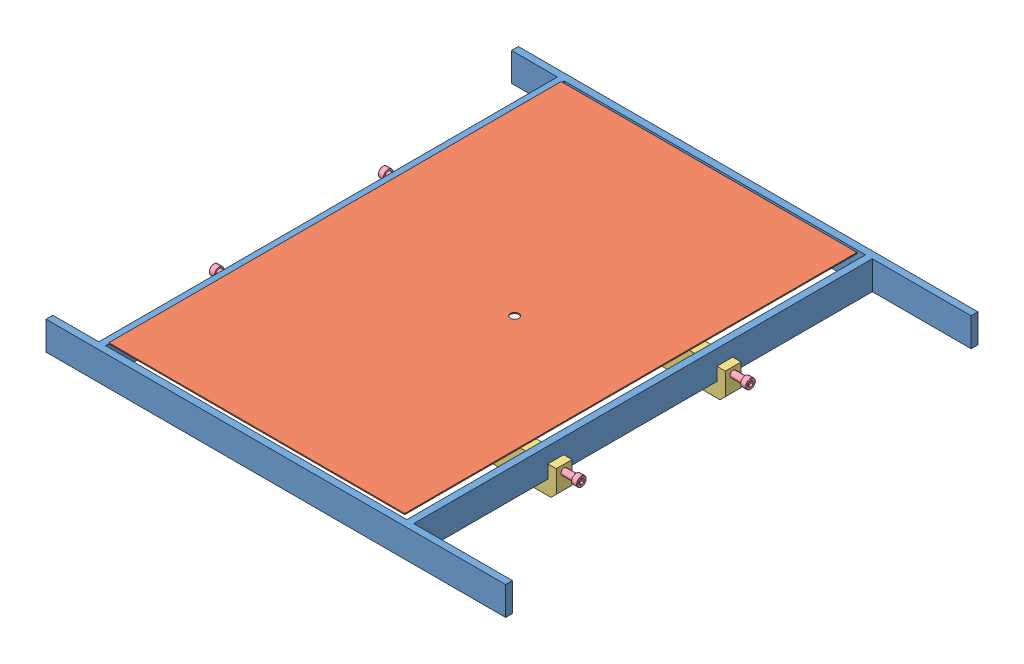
SolidWorks assembly cadre_2.SLDASM, configuration Défaut (file format 4400). Lengths in mm.
Overall size (435 41 447).
11 component instances, 7 part files, 15 mates.
Components (placement in the parent):
- cadre_machine-1: cadre_machine.SLDPRT [Défaut] at (98.5522 -12.8861 0) x (0 0 1) z (0 1 0) size (447 435 27)
- plaque_venturi-1: plaque_venturi.SLDPRT [Défaut] at (236.0522 14.1139 214) x (0 0 -1) z (0 1 0) size (428 280 1)
- barre_fixation-1: barre_fixation.SLDPRT [Défaut] at (98.5522 0.1139 -84.3844) x (0 0 1) z (1 0 0) size (15 26 315)
- vis_m6_20-1: vis_m6_20.SLDPRT [Défaut] at (267.5522 -5.8861 -76.8844) x (0 0.526652 0.850081) z (-1 0 0) size (9 9 25)
- vis_m6_20-2: vis_m6_20.SLDPRT [Défaut] at (-70.4478 -5.8861 -76.8844) x (0 0.164426 -0.986389) z (1 0 0) size (9 9 25)
- cadre_280_190-1: cadre_280_190.SLDPRT [Défaut] at (214.8263 0.1139 -139.2086) x (0 0 1) z (-1 0 0) size (308 14 230) (hidden)
- vis_m6_20-3: vis_m6_20.SLDPRT [Défaut] at (267.5522 -5.8861 83.1156) x (0 0.526652 0.850081) z (-1 0 0) size (9 9 25)
- vis_m6_20-4: vis_m6_20.SLDPRT [Défaut] at (-70.4478 -5.8861 83.1156) x (0 0.164426 -0.986389) z (1 0 0) size (9 9 25)
- barre_fixation-3: barre_fixation.SLDPRT [Défaut] at (98.5522 0.1139 75.6156) x (0 0 1) z (1 0 0) size (15 26 315)
- cadre_210_140-1: cadre_210_140.SLDPRT [Défaut] at (193.5717 0.1139 -107.7172) x (0 0 1) z (-1 0 0) size (238 14 180)
- cadre_140_90-1: cadre_140_90.SLDPRT [Défaut] at (47.685 14.1139 73.2979) x (0 0 -1) z (0 -1 0) size (168 130 14) (hidden)
Mates (geometry in assembly coordinates):
- Coïncidente23: coincident anti-aligned: plane of cadre_machine-1 through (-50.4478 14.1139 -223.5) normal (0 1 0); plane of plaque_venturi-1 through (-43.9478 14.1139 214) normal (0 -1 0)
- Coïncidente24: coincident anti-aligned: plane of cadre_machine-1 through (-43.9478 14.1139 -217) normal (1 0 0); plane of plaque_venturi-1 through (-43.9478 15.1139 214) normal (-1 0 0)
- Distance1: distance = 3 mm anti-aligned: plane of cadre_machine-1 through (241.0522 14.1139 -217) normal (0 0 1); plane of plaque_venturi-1 through (236.0522 15.1139 -214) normal (0 0 -1)
- Parallèle1: parallel aligned: plane of cadre_machine-1 through (247.5522 14.1139 -223.5) normal (0 0 -1); plane of cadre_280_190-1 through (-15.1737 0.1139 -153.2086) normal (0 0 -1)
- Coïncidente26: coincident aligned: plane of cadre_machine-1 through (-50.4478 14.1139 -223.5) normal (0 1 0); plane of cadre_280_190-1 through (-15.1737 14.1139 -139.2086) normal (0 1 0)
- Coïncidente27: coincident anti-aligned: plane of cadre_machine-1 through (241.0522 14.1139 -217) normal (-1 0 0); plane of barre_fixation-1 through (241.0522 9.43 -84.3844) normal (1 0 0)
- Coïncidente28: coincident anti-aligned: plane of cadre_machine-1 through (-50.4478 -12.8861 -223.5) normal (0 -1 0); plane of barre_fixation-1 through (248.0522 -12.8861 -84.3844) normal (0 1 0)
- Coïncidente29: coincident anti-aligned: plane of cadre_machine-1 through (247.5522 14.1139 -223.5) normal (1 0 0); plane of vis_m6_20-1 through (247.5522 -5.8861 -76.8844) normal (-1 0 0)
- Coïncidente30: coincident aligned: axis of barre_fixation-1 through (248.0522 -5.8861 -76.8844) axis (1 0 0); axis of vis_m6_20-1 through (248.0522 -5.8861 -76.8844) axis (1 0 0)
- Coïncidente31: coincident anti-aligned: plane of cadre_machine-1 through (-50.4478 14.1139 -223.5) normal (-1 0 0); plane of vis_m6_20-2 through (-50.4478 -5.8861 -76.8844) normal (1 0 0)
- Coïncidente32: coincident aligned: axis of barre_fixation-1 through (-50.9478 -5.8861 -76.8844) axis (-1 0 0); axis of vis_m6_20-2 through (-50.9478 -5.8861 -76.8844) axis (-1 0 0)
- Parallèle2: parallel aligned: plane of cadre_machine-1 through (247.5522 14.1139 -223.5) normal (0 0 -1); plane of cadre_140_90-1 through (191.484 14.1139 -80.7021) normal (0 0 -1)
- Coïncidente34: coincident aligned: plane of cadre_machine-1 through (-50.4478 14.1139 -223.5) normal (0 1 0); plane of cadre_140_90-1 through (191.484 14.1139 -66.7021) normal (0 1 0)
- Parallèle3: parallel aligned: plane of cadre_machine-1 through (247.5522 14.1139 223.5) normal (0 0 1); plane of cadre_210_140-1 through (13.5717 0.1139 116.2828) normal (0 0 1)
- Coïncidente36: coincident aligned: plane of cadre_machine-1 through (-50.4478 14.1139 -223.5) normal (0 1 0); plane of cadre_210_140-1 through (13.5717 14.1139 116.2828) normal (0 1 0)
